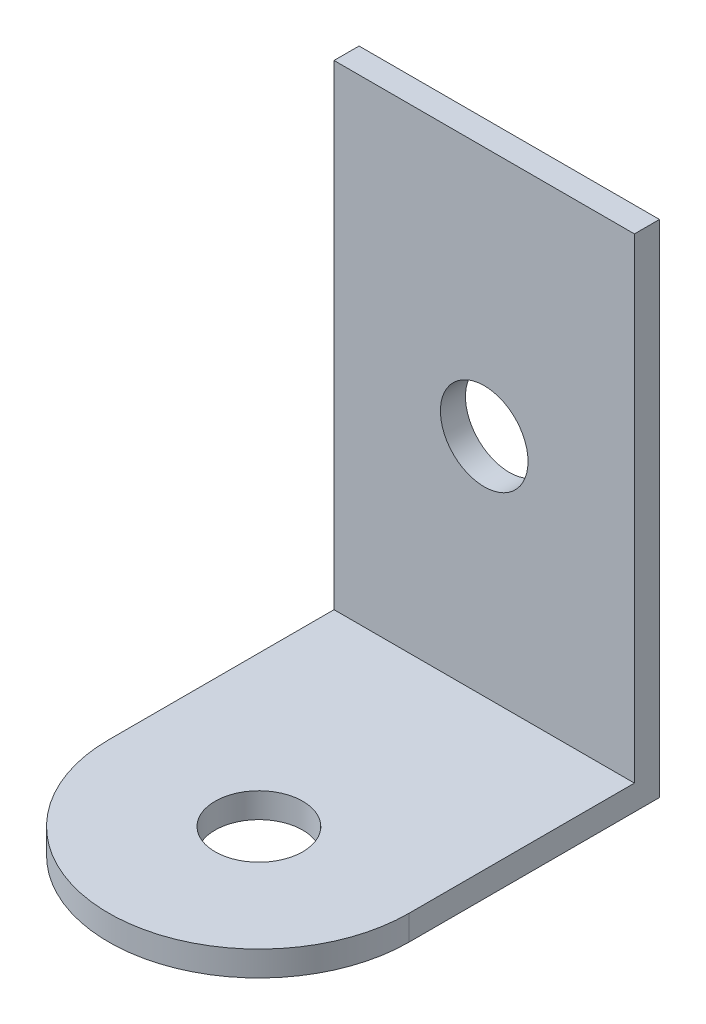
from build123d import *

# Parameters (mm, degrees)
SKETCH1_W      = 12
SKETCH1_H      = 20
SKETCH1_R      = 1.75
EXTRUDE1_DEPTH = 1
SKETCH3_R      = 1.75
EXTRUDE2_DEPTH = 1


with BuildPart() as part:
    # Sketch1 → Extrude1 (new body)
    with BuildSketch(Plane.XY):
        with Locations((6, 10)):
            Rectangle(SKETCH1_W, SKETCH1_H)
        with Locations((6, 10)):
            Circle(SKETCH1_R, mode=Mode.SUBTRACT)
    extrude(amount=EXTRUDE1_DEPTH)

    # Sketch3 → Extrude2 (add)
    with BuildSketch(Plane.XZ):
        with BuildLine():
            Line((0, 0), (12, 0))
            Line((12, 0), (12, 10))
            ThreePointArc((12, 10), (6, 16), (0, 10))
            Line((0, 10), (0, 0))
        make_face()
        with Locations((6, 10)):
            Circle(SKETCH3_R, mode=Mode.SUBTRACT)
    extrude(amount=-EXTRUDE2_DEPTH)


solid = part.part
